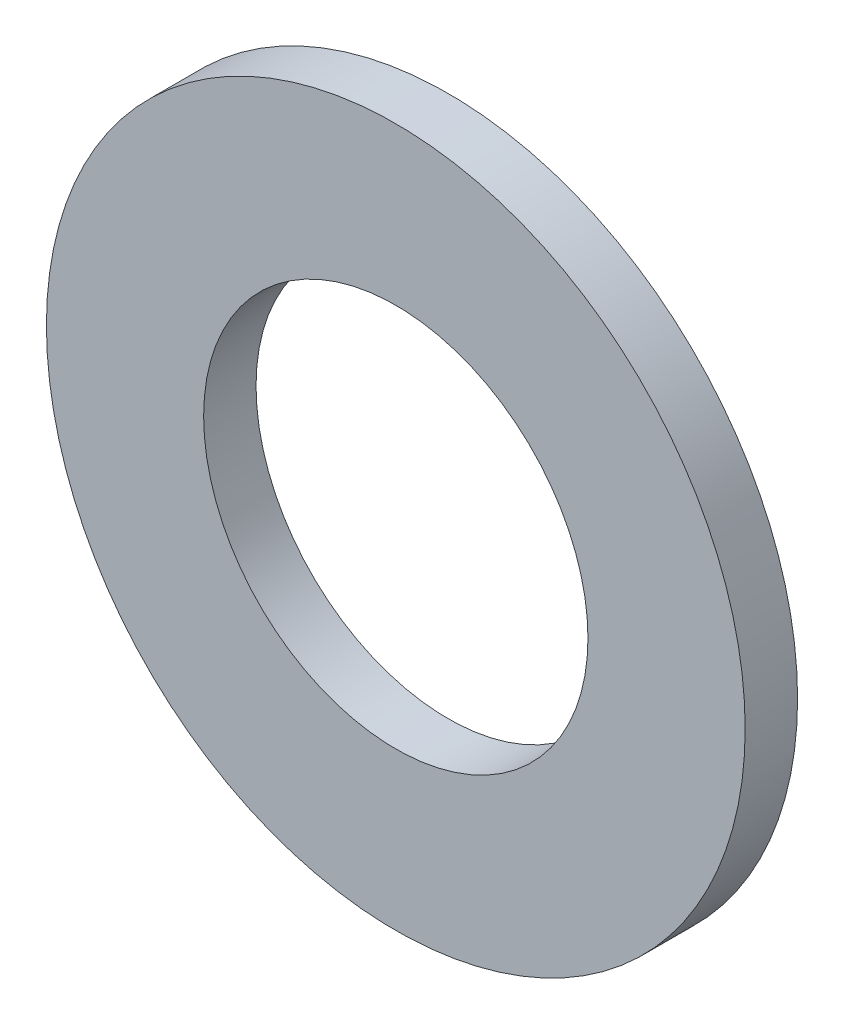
ISO-10303-21;
HEADER;
FILE_DESCRIPTION(('STEP AP214'),'2;1');
FILE_NAME('part.step','',(''),(''),'','','');
FILE_SCHEMA(('AUTOMOTIVE_DESIGN { 1 0 10303 214 1 1 1 1 }'));
ENDSEC;
DATA;
#1=APPLICATION_CONTEXT('core data for automotive mechanical design processes');
#2=APPLICATION_PROTOCOL_DEFINITION('international standard','automotive_design',2000,#1);
#3=PRODUCT_CONTEXT('',#1,'mechanical');
#4=PRODUCT('Part','Part','',(#3));
#5=PRODUCT_RELATED_PRODUCT_CATEGORY('part','',(#4));
#6=PRODUCT_DEFINITION_FORMATION('','',#4);
#7=PRODUCT_DEFINITION_CONTEXT('part definition',#1,'design');
#8=PRODUCT_DEFINITION('design','',#6,#7);
#9=PRODUCT_DEFINITION_SHAPE('','',#8);
#10=(LENGTH_UNIT() NAMED_UNIT(*) SI_UNIT(.MILLI.,.METRE.));
#11=(NAMED_UNIT(*) PLANE_ANGLE_UNIT() SI_UNIT($,.RADIAN.));
#12=(NAMED_UNIT(*) SI_UNIT($,.STERADIAN.) SOLID_ANGLE_UNIT());
#13=UNCERTAINTY_MEASURE_WITH_UNIT(LENGTH_MEASURE(1.E-05),#10,'distance_accuracy_value','');
#14=(GEOMETRIC_REPRESENTATION_CONTEXT(3) GLOBAL_UNCERTAINTY_ASSIGNED_CONTEXT((#13)) GLOBAL_UNIT_ASSIGNED_CONTEXT((#10,
#11,#12)) REPRESENTATION_CONTEXT('',''));
#15=CARTESIAN_POINT('',(0.,0.,0.));
#16=DIRECTION('',(0.,0.,1.));
#17=DIRECTION('',(1.,0.,0.));
#18=AXIS2_PLACEMENT_3D('',#15,#16,#17);
#19=CARTESIAN_POINT('',(0.,0.,1.5));
#20=DIRECTION('',(0.,0.,1.));
#21=DIRECTION('',(1.,0.,0.));
#22=AXIS2_PLACEMENT_3D('',#19,#20,#21);
#23=PLANE('',#22);
#24=CARTESIAN_POINT('',(0.,0.,1.5));
#25=DIRECTION('',(0.,0.,1.));
#26=DIRECTION('',(1.,0.,0.));
#27=AXIS2_PLACEMENT_3D('',#24,#25,#26);
#28=CIRCLE('',#27,20.);
#29=CARTESIAN_POINT('',(20.,0.,1.5));
#30=VERTEX_POINT('',#29);
#31=EDGE_CURVE('E10',#30,#30,#28,.T.);
#32=ORIENTED_EDGE('',*,*,#31,.T.);
#33=EDGE_LOOP('',(#32));
#34=FACE_BOUND('',#33,.T.);
#35=CARTESIAN_POINT('',(0.,0.,1.5));
#36=DIRECTION('',(0.,0.,1.));
#37=DIRECTION('',(1.,0.,0.));
#38=AXIS2_PLACEMENT_3D('',#35,#36,#37);
#39=CIRCLE('',#38,11.);
#40=CARTESIAN_POINT('',(11.,0.,1.5));
#41=VERTEX_POINT('',#40);
#42=EDGE_CURVE('E39',#41,#41,#39,.T.);
#43=ORIENTED_EDGE('',*,*,#42,.F.);
#44=EDGE_LOOP('',(#43));
#45=FACE_BOUND('',#44,.T.);
#46=ADVANCED_FACE('F28',(#34,#45),#23,.T.);
#47=CARTESIAN_POINT('',(0.,0.,-1.5));
#48=DIRECTION('',(0.,0.,1.));
#49=DIRECTION('',(1.,0.,0.));
#50=AXIS2_PLACEMENT_3D('',#47,#48,#49);
#51=PLANE('',#50);
#52=CARTESIAN_POINT('',(0.,0.,-1.5));
#53=DIRECTION('',(0.,0.,1.));
#54=DIRECTION('',(1.,0.,0.));
#55=AXIS2_PLACEMENT_3D('',#52,#53,#54);
#56=CIRCLE('',#55,20.);
#57=CARTESIAN_POINT('',(20.,0.,-1.5));
#58=VERTEX_POINT('',#57);
#59=EDGE_CURVE('E35',#58,#58,#56,.T.);
#60=ORIENTED_EDGE('',*,*,#59,.F.);
#61=EDGE_LOOP('',(#60));
#62=FACE_BOUND('',#61,.T.);
#63=CARTESIAN_POINT('',(0.,0.,-1.5));
#64=DIRECTION('',(0.,0.,1.));
#65=DIRECTION('',(1.,0.,0.));
#66=AXIS2_PLACEMENT_3D('',#63,#64,#65);
#67=CIRCLE('',#66,11.);
#68=CARTESIAN_POINT('',(11.,0.,-1.5));
#69=VERTEX_POINT('',#68);
#70=EDGE_CURVE('E43',#69,#69,#67,.T.);
#71=ORIENTED_EDGE('',*,*,#70,.T.);
#72=EDGE_LOOP('',(#71));
#73=FACE_BOUND('',#72,.T.);
#74=ADVANCED_FACE('F49',(#62,#73),#51,.F.);
#75=CARTESIAN_POINT('',(0.,0.,1.5));
#76=DIRECTION('',(0.,0.,-1.));
#77=DIRECTION('',(-1.,0.,0.));
#78=AXIS2_PLACEMENT_3D('',#75,#76,#77);
#79=CYLINDRICAL_SURFACE('',#78,20.);
#80=ORIENTED_EDGE('',*,*,#31,.F.);
#81=EDGE_LOOP('',(#80));
#82=FACE_BOUND('',#81,.T.);
#83=ORIENTED_EDGE('',*,*,#59,.T.);
#84=EDGE_LOOP('',(#83));
#85=FACE_BOUND('',#84,.T.);
#86=ADVANCED_FACE('F30',(#82,#85),#79,.T.);
#87=CARTESIAN_POINT('',(0.,0.,1.5));
#88=DIRECTION('',(0.,0.,-1.));
#89=DIRECTION('',(-1.,0.,0.));
#90=AXIS2_PLACEMENT_3D('',#87,#88,#89);
#91=CYLINDRICAL_SURFACE('',#90,11.);
#92=ORIENTED_EDGE('',*,*,#42,.T.);
#93=EDGE_LOOP('',(#92));
#94=FACE_BOUND('',#93,.T.);
#95=ORIENTED_EDGE('',*,*,#70,.F.);
#96=EDGE_LOOP('',(#95));
#97=FACE_BOUND('',#96,.T.);
#98=ADVANCED_FACE('F51',(#94,#97),#91,.F.);
#99=CLOSED_SHELL('',(#46,#74,#86,#98));
#100=MANIFOLD_SOLID_BREP('B2',#99);
#101=ADVANCED_BREP_SHAPE_REPRESENTATION('',(#18,#100),#14);
#102=SHAPE_DEFINITION_REPRESENTATION(#9,#101);
ENDSEC;
END-ISO-10303-21;
